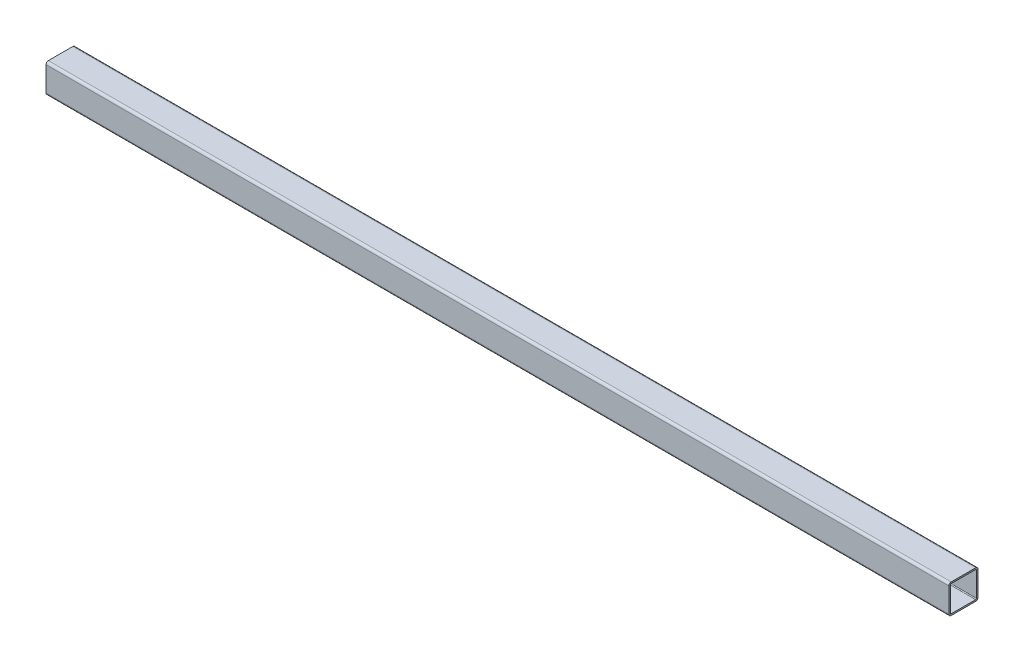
from build123d import *

# Parameters (mm, degrees)
BOSS_EXTRUDE1_DEPTH = 393.7
SCALE1_SCALE_X      = 1
SCALE1_SCALE_Y      = 0.4
SCALE1_SCALE_Z      = 0.4


with BuildPart() as part:
    # Sketch1 → Boss-Extrude1 (new body)
    with BuildSketch(Plane(origin=(0, 0, 0), x_dir=(0, 0, -1), z_dir=(1, 0, 0))):
        with BuildLine():
            Line((0, 2.54), (0, 29.21))
            ThreePointArc((0, 29.21), (-0.743948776, 31.006051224), (-2.54, 31.75))
            Line((-2.54, 31.75), (-29.21, 31.75))
            ThreePointArc((-29.21, 31.75), (-31.006051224, 31.006051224), (-31.75, 29.21))
            Line((-31.75, 29.21), (-31.75, 2.54))
            ThreePointArc((-31.75, 2.54), (-31.006051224, 0.743948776), (-29.21, 0))
            Line((-29.21, 0), (-2.54, 0))
            ThreePointArc((-2.54, 0), (-0.743948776, 0.743948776), (0, 2.54))
        make_face()
        with BuildLine():
            Line((-1.651, 2.54), (-1.651, 29.21))
            ThreePointArc((-1.651, 29.21), (-1.911382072, 29.838617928), (-2.54, 30.099))
            Line((-2.54, 30.099), (-29.21, 30.099))
            ThreePointArc((-29.21, 30.099), (-29.838617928, 29.838617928), (-30.099, 29.21))
            Line((-30.099, 29.21), (-30.099, 2.54))
            ThreePointArc((-30.099, 2.54), (-29.838617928, 1.911382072), (-29.21, 1.651))
            Line((-29.21, 1.651), (-2.54, 1.651))
            ThreePointArc((-2.54, 1.651), (-1.911382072, 1.911382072), (-1.651, 2.54))
        make_face(mode=Mode.SUBTRACT)
    extrude(amount=BOSS_EXTRUDE1_DEPTH)


with BuildPart() as part_1:
    # Scale1: scaled about (196.85, 15.875, 15.875)
    add(part.part.scale((SCALE1_SCALE_X, SCALE1_SCALE_Y, SCALE1_SCALE_Z), about=(196.85, 15.875, 15.875)))


solid = part_1.part
